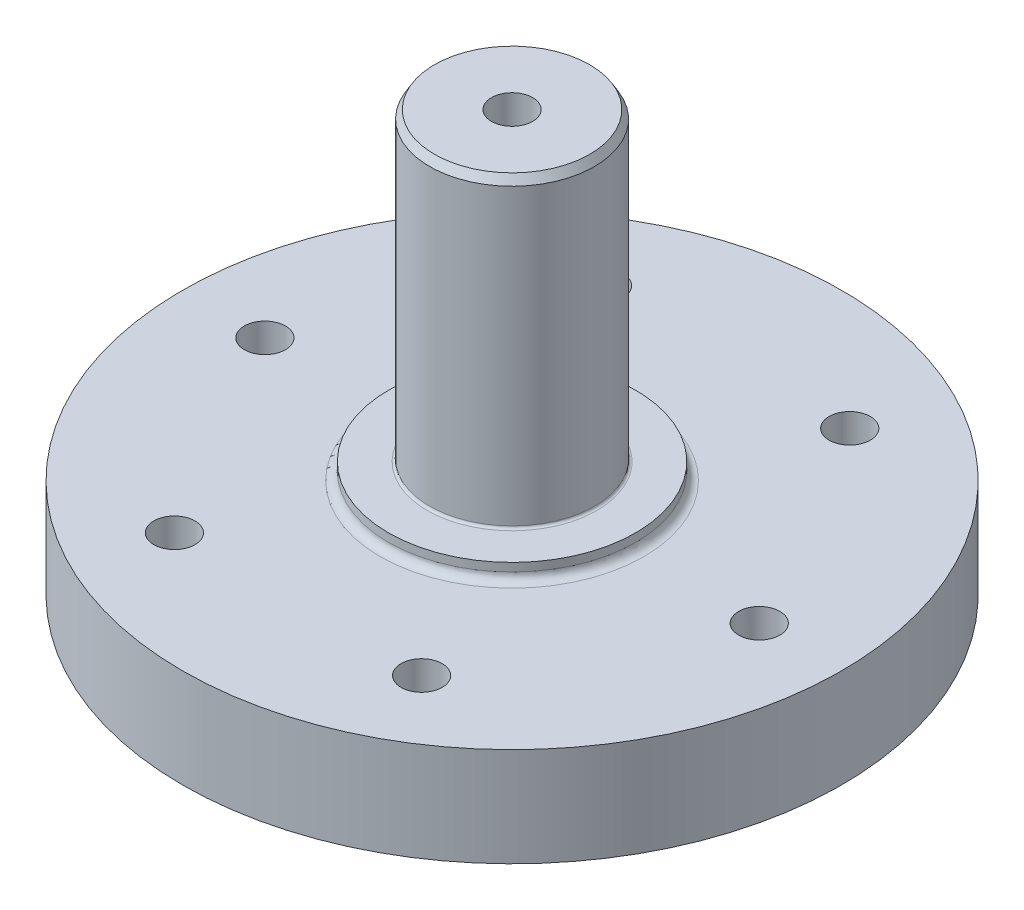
ISO-10303-21;
HEADER;
FILE_DESCRIPTION(('STEP AP214'),'2;1');
FILE_NAME('part.step','',(''),(''),'','','');
FILE_SCHEMA(('AUTOMOTIVE_DESIGN { 1 0 10303 214 1 1 1 1 }'));
ENDSEC;
DATA;
#1=APPLICATION_CONTEXT('core data for automotive mechanical design processes');
#2=APPLICATION_PROTOCOL_DEFINITION('international standard','automotive_design',2000,#1);
#3=PRODUCT_CONTEXT('',#1,'mechanical');
#4=PRODUCT('Part','Part','',(#3));
#5=PRODUCT_RELATED_PRODUCT_CATEGORY('part','',(#4));
#6=PRODUCT_DEFINITION_FORMATION('','',#4);
#7=PRODUCT_DEFINITION_CONTEXT('part definition',#1,'design');
#8=PRODUCT_DEFINITION('design','',#6,#7);
#9=PRODUCT_DEFINITION_SHAPE('','',#8);
#10=(LENGTH_UNIT() NAMED_UNIT(*) SI_UNIT(.MILLI.,.METRE.));
#11=(NAMED_UNIT(*) PLANE_ANGLE_UNIT() SI_UNIT($,.RADIAN.));
#12=(NAMED_UNIT(*) SI_UNIT($,.STERADIAN.) SOLID_ANGLE_UNIT());
#13=UNCERTAINTY_MEASURE_WITH_UNIT(LENGTH_MEASURE(1.E-05),#10,'distance_accuracy_value','');
#14=(GEOMETRIC_REPRESENTATION_CONTEXT(3) GLOBAL_UNCERTAINTY_ASSIGNED_CONTEXT((#13)) GLOBAL_UNIT_ASSIGNED_CONTEXT((#10,
#11,#12)) REPRESENTATION_CONTEXT('',''));
#15=CARTESIAN_POINT('',(0.,0.,0.));
#16=DIRECTION('',(0.,0.,1.));
#17=DIRECTION('',(1.,0.,0.));
#18=AXIS2_PLACEMENT_3D('',#15,#16,#17);
#19=CARTESIAN_POINT('',(10.,51.,0.));
#20=DIRECTION('',(0.,-1.,0.));
#21=DIRECTION('',(0.,0.,-1.));
#22=AXIS2_PLACEMENT_3D('',#19,#20,#21);
#23=PLANE('',#22);
#24=CARTESIAN_POINT('',(0.,51.,0.));
#25=DIRECTION('',(0.,-1.,0.));
#26=DIRECTION('',(0.,0.,-1.));
#27=AXIS2_PLACEMENT_3D('',#24,#25,#26);
#28=CIRCLE('',#27,9.42264973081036);
#29=CARTESIAN_POINT('',(0.,51.,-9.42264973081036));
#30=VERTEX_POINT('',#29);
#31=EDGE_CURVE('E113',#30,#30,#28,.F.);
#32=ORIENTED_EDGE('',*,*,#31,.T.);
#33=EDGE_LOOP('',(#32));
#34=FACE_BOUND('',#33,.T.);
#35=CARTESIAN_POINT('',(0.,51.,0.));
#36=DIRECTION('',(0.,1.,0.));
#37=DIRECTION('',(0.,0.,1.));
#38=AXIS2_PLACEMENT_3D('',#35,#36,#37);
#39=CIRCLE('',#38,2.5);
#40=CARTESIAN_POINT('',(0.,51.,2.5));
#41=VERTEX_POINT('',#40);
#42=EDGE_CURVE('E180',#41,#41,#39,.T.);
#43=ORIENTED_EDGE('',*,*,#42,.F.);
#44=EDGE_LOOP('',(#43));
#45=FACE_BOUND('',#44,.T.);
#46=ADVANCED_FACE('F30',(#34,#45),#23,.F.);
#47=CARTESIAN_POINT('',(0.,-5.,0.));
#48=DIRECTION('',(0.,1.,0.));
#49=DIRECTION('',(0.,0.,1.));
#50=AXIS2_PLACEMENT_3D('',#47,#48,#49);
#51=PLANE('',#50);
#52=CARTESIAN_POINT('',(0.,-5.,0.));
#53=DIRECTION('',(0.,1.,0.));
#54=DIRECTION('',(0.,0.,1.));
#55=AXIS2_PLACEMENT_3D('',#52,#53,#54);
#56=CIRCLE('',#55,9.13397459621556);
#57=CARTESIAN_POINT('',(0.,-5.,9.13397459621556));
#58=VERTEX_POINT('',#57);
#59=EDGE_CURVE('E106',#58,#58,#56,.T.);
#60=ORIENTED_EDGE('',*,*,#59,.F.);
#61=EDGE_LOOP('',(#60));
#62=FACE_BOUND('',#61,.T.);
#63=ADVANCED_FACE('F32',(#62),#51,.F.);
#64=CARTESIAN_POINT('',(0.,-3.5,0.));
#65=DIRECTION('',(0.,1.,0.));
#66=DIRECTION('',(0.,0.,1.));
#67=AXIS2_PLACEMENT_3D('',#64,#65,#66);
#68=CONICAL_SURFACE('',#67,10.,0.523598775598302);
#69=ORIENTED_EDGE('',*,*,#59,.T.);
#70=EDGE_LOOP('',(#69));
#71=FACE_BOUND('',#70,.T.);
#72=CARTESIAN_POINT('',(0.,-3.5,0.));
#73=DIRECTION('',(0.,1.,0.));
#74=DIRECTION('',(0.,0.,1.));
#75=AXIS2_PLACEMENT_3D('',#72,#73,#74);
#76=CIRCLE('',#75,10.);
#77=CARTESIAN_POINT('',(0.,-3.5,10.));
#78=VERTEX_POINT('',#77);
#79=EDGE_CURVE('E109',#78,#78,#76,.T.);
#80=ORIENTED_EDGE('',*,*,#79,.F.);
#81=EDGE_LOOP('',(#80));
#82=FACE_BOUND('',#81,.T.);
#83=ADVANCED_FACE('F64',(#71,#82),#68,.T.);
#84=CARTESIAN_POINT('',(0.,25.7125,0.));
#85=DIRECTION('',(0.,1.,0.));
#86=DIRECTION('',(0.,0.,1.));
#87=AXIS2_PLACEMENT_3D('',#84,#85,#86);
#88=CYLINDRICAL_SURFACE('',#87,10.);
#89=CARTESIAN_POINT('',(0.,0.,0.));
#90=DIRECTION('',(0.,1.,0.));
#91=DIRECTION('',(0.,0.,1.));
#92=AXIS2_PLACEMENT_3D('',#89,#90,#91);
#93=CIRCLE('',#92,10.);
#94=CARTESIAN_POINT('',(0.,0.,10.));
#95=VERTEX_POINT('',#94);
#96=EDGE_CURVE('E111',#95,#95,#93,.T.);
#97=ORIENTED_EDGE('',*,*,#96,.F.);
#98=EDGE_LOOP('',(#97));
#99=FACE_BOUND('',#98,.T.);
#100=ORIENTED_EDGE('',*,*,#79,.T.);
#101=EDGE_LOOP('',(#100));
#102=FACE_BOUND('',#101,.T.);
#103=ADVANCED_FACE('F95',(#99,#102),#88,.T.);
#104=CARTESIAN_POINT('',(10.,0.,0.));
#105=DIRECTION('',(0.,1.,0.));
#106=DIRECTION('',(0.,0.,1.));
#107=AXIS2_PLACEMENT_3D('',#104,#105,#106);
#108=PLANE('',#107);
#109=CARTESIAN_POINT('',(30.,0.,-4.14598910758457E-13));
#110=DIRECTION('',(0.,1.,0.));
#111=DIRECTION('',(0.,0.,1.));
#112=AXIS2_PLACEMENT_3D('',#109,#110,#111);
#113=CIRCLE('',#112,2.5);
#114=CARTESIAN_POINT('',(30.,0.,2.49999999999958));
#115=VERTEX_POINT('',#114);
#116=EDGE_CURVE('E232',#115,#115,#113,.T.);
#117=ORIENTED_EDGE('',*,*,#116,.T.);
#118=EDGE_LOOP('',(#117));
#119=FACE_BOUND('',#118,.T.);
#120=CARTESIAN_POINT('',(15.0000000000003,0.,25.980762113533));
#121=DIRECTION('',(0.,1.,0.));
#122=DIRECTION('',(0.,0.,1.));
#123=AXIS2_PLACEMENT_3D('',#120,#121,#122);
#124=CIRCLE('',#123,2.5);
#125=CARTESIAN_POINT('',(15.0000000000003,0.,28.480762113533));
#126=VERTEX_POINT('',#125);
#127=EDGE_CURVE('E226',#126,#126,#124,.T.);
#128=ORIENTED_EDGE('',*,*,#127,.T.);
#129=EDGE_LOOP('',(#128));
#130=FACE_BOUND('',#129,.T.);
#131=CARTESIAN_POINT('',(-14.9999999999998,0.,25.9807621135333));
#132=DIRECTION('',(0.,1.,0.));
#133=DIRECTION('',(0.,0.,1.));
#134=AXIS2_PLACEMENT_3D('',#131,#132,#133);
#135=CIRCLE('',#134,2.5);
#136=CARTESIAN_POINT('',(-14.9999999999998,0.,28.4807621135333));
#137=VERTEX_POINT('',#136);
#138=EDGE_CURVE('E220',#137,#137,#135,.T.);
#139=ORIENTED_EDGE('',*,*,#138,.T.);
#140=EDGE_LOOP('',(#139));
#141=FACE_BOUND('',#140,.T.);
#142=CARTESIAN_POINT('',(-30.,0.,2.0643209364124E-13));
#143=DIRECTION('',(0.,1.,0.));
#144=DIRECTION('',(0.,0.,1.));
#145=AXIS2_PLACEMENT_3D('',#142,#143,#144);
#146=CIRCLE('',#145,2.5);
#147=CARTESIAN_POINT('',(-30.,0.,2.5000000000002));
#148=VERTEX_POINT('',#147);
#149=EDGE_CURVE('E172',#148,#148,#146,.T.);
#150=ORIENTED_EDGE('',*,*,#149,.T.);
#151=EDGE_LOOP('',(#150));
#152=FACE_BOUND('',#151,.T.);
#153=CARTESIAN_POINT('',(-15.0000000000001,0.,-25.9807621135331));
#154=DIRECTION('',(0.,1.,0.));
#155=DIRECTION('',(0.,0.,1.));
#156=AXIS2_PLACEMENT_3D('',#153,#154,#155);
#157=CIRCLE('',#156,2.5);
#158=CARTESIAN_POINT('',(-15.0000000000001,0.,-23.4807621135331));
#159=VERTEX_POINT('',#158);
#160=EDGE_CURVE('E165',#159,#159,#157,.T.);
#161=ORIENTED_EDGE('',*,*,#160,.T.);
#162=EDGE_LOOP('',(#161));
#163=FACE_BOUND('',#162,.T.);
#164=CARTESIAN_POINT('',(14.9999999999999,0.,-25.9807621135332));
#165=DIRECTION('',(0.,1.,0.));
#166=DIRECTION('',(0.,0.,1.));
#167=AXIS2_PLACEMENT_3D('',#164,#165,#166);
#168=CIRCLE('',#167,2.5);
#169=CARTESIAN_POINT('',(14.9999999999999,0.,-23.4807621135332));
#170=VERTEX_POINT('',#169);
#171=EDGE_CURVE('E170',#170,#170,#168,.T.);
#172=ORIENTED_EDGE('',*,*,#171,.T.);
#173=EDGE_LOOP('',(#172));
#174=FACE_BOUND('',#173,.T.);
#175=CARTESIAN_POINT('',(0.,0.,0.));
#176=DIRECTION('',(0.,1.,0.));
#177=DIRECTION('',(0.,0.,1.));
#178=AXIS2_PLACEMENT_3D('',#175,#176,#177);
#179=CIRCLE('',#178,40.);
#180=CARTESIAN_POINT('',(0.,0.,40.));
#181=VERTEX_POINT('',#180);
#182=EDGE_CURVE('E116',#181,#181,#179,.T.);
#183=ORIENTED_EDGE('',*,*,#182,.F.);
#184=EDGE_LOOP('',(#183));
#185=FACE_BOUND('',#184,.T.);
#186=ORIENTED_EDGE('',*,*,#96,.T.);
#187=EDGE_LOOP('',(#186));
#188=FACE_BOUND('',#187,.T.);
#189=ADVANCED_FACE('F91',(#119,#130,#141,#152,#163,#174,#185,#188),#108,.F.);
#190=CARTESIAN_POINT('',(0.,25.7125,0.));
#191=DIRECTION('',(0.,1.,0.));
#192=DIRECTION('',(0.,0.,1.));
#193=AXIS2_PLACEMENT_3D('',#190,#191,#192);
#194=CYLINDRICAL_SURFACE('',#193,40.);
#195=CARTESIAN_POINT('',(0.,12.,0.));
#196=DIRECTION('',(0.,1.,0.));
#197=DIRECTION('',(0.,0.,1.));
#198=AXIS2_PLACEMENT_3D('',#195,#196,#197);
#199=CIRCLE('',#198,40.);
#200=CARTESIAN_POINT('',(0.,12.,40.));
#201=VERTEX_POINT('',#200);
#202=EDGE_CURVE('E192',#201,#201,#199,.T.);
#203=ORIENTED_EDGE('',*,*,#202,.F.);
#204=EDGE_LOOP('',(#203));
#205=FACE_BOUND('',#204,.T.);
#206=ORIENTED_EDGE('',*,*,#182,.T.);
#207=EDGE_LOOP('',(#206));
#208=FACE_BOUND('',#207,.T.);
#209=ADVANCED_FACE('F87',(#205,#208),#194,.T.);
#210=CARTESIAN_POINT('',(40.,12.,0.));
#211=DIRECTION('',(0.,-1.,0.));
#212=DIRECTION('',(0.,0.,-1.));
#213=AXIS2_PLACEMENT_3D('',#210,#211,#212);
#214=PLANE('',#213);
#215=CARTESIAN_POINT('',(30.,12.,-4.14598910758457E-13));
#216=DIRECTION('',(0.,1.,0.));
#217=DIRECTION('',(-0.866025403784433,0.,0.50000000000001));
#218=AXIS2_PLACEMENT_3D('',#215,#216,#217);
#219=CIRCLE('',#218,2.5);
#220=CARTESIAN_POINT('',(27.8349364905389,12.,1.24999999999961));
#221=VERTEX_POINT('',#220);
#222=EDGE_CURVE('E235',#221,#221,#219,.T.);
#223=ORIENTED_EDGE('',*,*,#222,.F.);
#224=EDGE_LOOP('',(#223));
#225=FACE_BOUND('',#224,.T.);
#226=CARTESIAN_POINT('',(15.0000000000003,12.,25.980762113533));
#227=DIRECTION('',(0.,1.,0.));
#228=DIRECTION('',(-0.866025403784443,0.,-0.499999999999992));
#229=AXIS2_PLACEMENT_3D('',#226,#227,#228);
#230=CIRCLE('',#229,2.5);
#231=CARTESIAN_POINT('',(12.8349364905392,12.,24.730762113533));
#232=VERTEX_POINT('',#231);
#233=EDGE_CURVE('E229',#232,#232,#230,.T.);
#234=ORIENTED_EDGE('',*,*,#233,.F.);
#235=EDGE_LOOP('',(#234));
#236=FACE_BOUND('',#235,.T.);
#237=CARTESIAN_POINT('',(-14.9999999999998,12.,25.9807621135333));
#238=DIRECTION('',(0.,1.,0.));
#239=DIRECTION('',(0.,0.,-1.));
#240=AXIS2_PLACEMENT_3D('',#237,#238,#239);
#241=CIRCLE('',#240,2.5);
#242=CARTESIAN_POINT('',(-14.9999999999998,12.,23.4807621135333));
#243=VERTEX_POINT('',#242);
#244=EDGE_CURVE('E223',#243,#243,#241,.T.);
#245=ORIENTED_EDGE('',*,*,#244,.F.);
#246=EDGE_LOOP('',(#245));
#247=FACE_BOUND('',#246,.T.);
#248=CARTESIAN_POINT('',(-30.,12.,2.0643209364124E-13));
#249=DIRECTION('',(0.,1.,0.));
#250=DIRECTION('',(0.866025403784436,0.,-0.500000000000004));
#251=AXIS2_PLACEMENT_3D('',#248,#249,#250);
#252=CIRCLE('',#251,2.5);
#253=CARTESIAN_POINT('',(-27.8349364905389,12.,-1.2499999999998));
#254=VERTEX_POINT('',#253);
#255=EDGE_CURVE('E217',#254,#254,#252,.T.);
#256=ORIENTED_EDGE('',*,*,#255,.F.);
#257=EDGE_LOOP('',(#256));
#258=FACE_BOUND('',#257,.T.);
#259=CARTESIAN_POINT('',(-15.0000000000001,12.,-25.9807621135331));
#260=DIRECTION('',(0.,1.,0.));
#261=DIRECTION('',(0.86602540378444,0.,0.499999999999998));
#262=AXIS2_PLACEMENT_3D('',#259,#260,#261);
#263=CIRCLE('',#262,2.5);
#264=CARTESIAN_POINT('',(-12.834936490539,12.,-24.7307621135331));
#265=VERTEX_POINT('',#264);
#266=EDGE_CURVE('E162',#265,#265,#263,.T.);
#267=ORIENTED_EDGE('',*,*,#266,.F.);
#268=EDGE_LOOP('',(#267));
#269=FACE_BOUND('',#268,.T.);
#270=CARTESIAN_POINT('',(14.9999999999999,12.,-25.9807621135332));
#271=DIRECTION('',(0.,1.,0.));
#272=DIRECTION('',(0.,0.,1.));
#273=AXIS2_PLACEMENT_3D('',#270,#271,#272);
#274=CIRCLE('',#273,2.5);
#275=CARTESIAN_POINT('',(14.9999999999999,12.,-23.4807621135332));
#276=VERTEX_POINT('',#275);
#277=EDGE_CURVE('E167',#276,#276,#274,.T.);
#278=ORIENTED_EDGE('',*,*,#277,.F.);
#279=EDGE_LOOP('',(#278));
#280=FACE_BOUND('',#279,.T.);
#281=CARTESIAN_POINT('',(0.,12.,0.));
#282=DIRECTION('',(0.,1.,0.));
#283=DIRECTION('',(0.,0.,1.));
#284=AXIS2_PLACEMENT_3D('',#281,#282,#283);
#285=CIRCLE('',#284,16.);
#286=CARTESIAN_POINT('',(0.,12.,16.));
#287=VERTEX_POINT('',#286);
#288=EDGE_CURVE('E189',#287,#287,#285,.T.);
#289=ORIENTED_EDGE('',*,*,#288,.F.);
#290=EDGE_LOOP('',(#289));
#291=FACE_BOUND('',#290,.T.);
#292=ORIENTED_EDGE('',*,*,#202,.T.);
#293=EDGE_LOOP('',(#292));
#294=FACE_BOUND('',#293,.T.);
#295=ADVANCED_FACE('F83',(#225,#236,#247,#258,#269,#280,#291,#294),#214,.F.);
#296=CARTESIAN_POINT('',(0.,13.,0.));
#297=DIRECTION('',(0.,1.,0.));
#298=DIRECTION('',(0.,0.,1.));
#299=AXIS2_PLACEMENT_3D('',#296,#297,#298);
#300=TOROIDAL_SURFACE('',#299,16.,1.);
#301=ORIENTED_EDGE('',*,*,#288,.T.);
#302=EDGE_LOOP('',(#301));
#303=FACE_BOUND('',#302,.T.);
#304=CARTESIAN_POINT('',(0.,13.,0.));
#305=DIRECTION('',(0.,1.,0.));
#306=DIRECTION('',(0.,0.,1.));
#307=AXIS2_PLACEMENT_3D('',#304,#305,#306);
#308=CIRCLE('',#307,15.);
#309=CARTESIAN_POINT('',(0.,13.,15.));
#310=VERTEX_POINT('',#309);
#311=EDGE_CURVE('E186',#310,#310,#308,.T.);
#312=ORIENTED_EDGE('',*,*,#311,.F.);
#313=EDGE_LOOP('',(#312));
#314=FACE_BOUND('',#313,.T.);
#315=ADVANCED_FACE('F79',(#303,#314),#300,.F.);
#316=CARTESIAN_POINT('',(0.,25.7125,0.));
#317=DIRECTION('',(0.,1.,0.));
#318=DIRECTION('',(0.,0.,1.));
#319=AXIS2_PLACEMENT_3D('',#316,#317,#318);
#320=CYLINDRICAL_SURFACE('',#319,15.);
#321=CARTESIAN_POINT('',(0.,14.,0.));
#322=DIRECTION('',(0.,1.,0.));
#323=DIRECTION('',(0.,0.,1.));
#324=AXIS2_PLACEMENT_3D('',#321,#322,#323);
#325=CIRCLE('',#324,15.);
#326=CARTESIAN_POINT('',(0.,14.,15.));
#327=VERTEX_POINT('',#326);
#328=EDGE_CURVE('E183',#327,#327,#325,.T.);
#329=ORIENTED_EDGE('',*,*,#328,.F.);
#330=EDGE_LOOP('',(#329));
#331=FACE_BOUND('',#330,.T.);
#332=ORIENTED_EDGE('',*,*,#311,.T.);
#333=EDGE_LOOP('',(#332));
#334=FACE_BOUND('',#333,.T.);
#335=ADVANCED_FACE('F75',(#331,#334),#320,.T.);
#336=CARTESIAN_POINT('',(15.,14.,0.));
#337=DIRECTION('',(0.,-1.,0.));
#338=DIRECTION('',(0.,0.,-1.));
#339=AXIS2_PLACEMENT_3D('',#336,#337,#338);
#340=PLANE('',#339);
#341=CARTESIAN_POINT('',(0.,14.,0.));
#342=DIRECTION('',(0.,-1.,0.));
#343=DIRECTION('',(0.,0.,-1.));
#344=AXIS2_PLACEMENT_3D('',#341,#342,#343);
#345=CIRCLE('',#344,10.3);
#346=CARTESIAN_POINT('',(0.,14.,-10.3));
#347=VERTEX_POINT('',#346);
#348=EDGE_CURVE('E11',#347,#347,#345,.T.);
#349=ORIENTED_EDGE('',*,*,#348,.T.);
#350=EDGE_LOOP('',(#349));
#351=FACE_BOUND('',#350,.T.);
#352=ORIENTED_EDGE('',*,*,#328,.T.);
#353=EDGE_LOOP('',(#352));
#354=FACE_BOUND('',#353,.T.);
#355=ADVANCED_FACE('F71',(#351,#354),#340,.F.);
#356=CARTESIAN_POINT('',(0.,25.7125,0.));
#357=DIRECTION('',(0.,1.,0.));
#358=DIRECTION('',(0.,0.,1.));
#359=AXIS2_PLACEMENT_3D('',#356,#357,#358);
#360=CYLINDRICAL_SURFACE('',#359,10.);
#361=CARTESIAN_POINT('',(0.,14.3,0.));
#362=DIRECTION('',(0.,-1.,0.));
#363=DIRECTION('',(0.,0.,-1.));
#364=AXIS2_PLACEMENT_3D('',#361,#362,#363);
#365=CIRCLE('',#364,10.);
#366=CARTESIAN_POINT('',(0.,14.3,-10.));
#367=VERTEX_POINT('',#366);
#368=EDGE_CURVE('E37',#367,#367,#365,.F.);
#369=ORIENTED_EDGE('',*,*,#368,.T.);
#370=EDGE_LOOP('',(#369));
#371=FACE_BOUND('',#370,.T.);
#372=CARTESIAN_POINT('',(0.,50.,0.));
#373=DIRECTION('',(0.,-1.,0.));
#374=DIRECTION('',(0.,0.,-1.));
#375=AXIS2_PLACEMENT_3D('',#372,#373,#374);
#376=CIRCLE('',#375,10.);
#377=CARTESIAN_POINT('',(0.,50.,-10.));
#378=VERTEX_POINT('',#377);
#379=EDGE_CURVE('E121',#378,#378,#376,.T.);
#380=ORIENTED_EDGE('',*,*,#379,.T.);
#381=EDGE_LOOP('',(#380));
#382=FACE_BOUND('',#381,.T.);
#383=ADVANCED_FACE('F54',(#371,#382),#360,.T.);
#384=CARTESIAN_POINT('',(0.,51.,0.));
#385=DIRECTION('',(0.,1.,0.));
#386=DIRECTION('',(0.,0.,1.));
#387=AXIS2_PLACEMENT_3D('',#384,#385,#386);
#388=CYLINDRICAL_SURFACE('',#387,2.5);
#389=ORIENTED_EDGE('',*,*,#42,.T.);
#390=EDGE_LOOP('',(#389));
#391=FACE_BOUND('',#390,.T.);
#392=CARTESIAN_POINT('',(0.,34.,0.));
#393=DIRECTION('',(0.,1.,0.));
#394=DIRECTION('',(0.,0.,1.));
#395=AXIS2_PLACEMENT_3D('',#392,#393,#394);
#396=CIRCLE('',#395,2.5);
#397=CARTESIAN_POINT('',(0.,34.,2.5));
#398=VERTEX_POINT('',#397);
#399=EDGE_CURVE('E178',#398,#398,#396,.T.);
#400=ORIENTED_EDGE('',*,*,#399,.F.);
#401=EDGE_LOOP('',(#400));
#402=FACE_BOUND('',#401,.T.);
#403=ADVANCED_FACE('F43',(#391,#402),#388,.F.);
#404=CARTESIAN_POINT('',(0.,32.4978484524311,0.));
#405=DIRECTION('',(0.,1.,0.));
#406=DIRECTION('',(0.,0.,1.));
#407=AXIS2_PLACEMENT_3D('',#404,#405,#406);
#408=CONICAL_SURFACE('',#407,0.,1.02974425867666);
#409=ORIENTED_EDGE('',*,*,#399,.T.);
#410=EDGE_LOOP('',(#409));
#411=FACE_BOUND('',#410,.T.);
#412=CARTESIAN_POINT('',(0.,32.4978484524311,0.));
#413=VERTEX_POINT('',#412);
#414=VERTEX_LOOP('',#413);
#415=FACE_BOUND('',#414,.T.);
#416=ADVANCED_FACE('F40',(#411,#415),#408,.F.);
#417=CARTESIAN_POINT('',(14.9999999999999,-5.,-25.9807621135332));
#418=DIRECTION('',(0.,1.,0.));
#419=DIRECTION('',(0.,0.,1.));
#420=AXIS2_PLACEMENT_3D('',#417,#418,#419);
#421=CYLINDRICAL_SURFACE('',#420,2.5);
#422=ORIENTED_EDGE('',*,*,#277,.T.);
#423=EDGE_LOOP('',(#422));
#424=FACE_BOUND('',#423,.T.);
#425=ORIENTED_EDGE('',*,*,#171,.F.);
#426=EDGE_LOOP('',(#425));
#427=FACE_BOUND('',#426,.T.);
#428=ADVANCED_FACE('F42',(#424,#427),#421,.F.);
#429=CARTESIAN_POINT('',(-15.0000000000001,-5.,-25.9807621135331));
#430=DIRECTION('',(0.,1.,0.));
#431=DIRECTION('',(0.,0.,1.));
#432=AXIS2_PLACEMENT_3D('',#429,#430,#431);
#433=CYLINDRICAL_SURFACE('',#432,2.5);
#434=ORIENTED_EDGE('',*,*,#266,.T.);
#435=EDGE_LOOP('',(#434));
#436=FACE_BOUND('',#435,.T.);
#437=ORIENTED_EDGE('',*,*,#160,.F.);
#438=EDGE_LOOP('',(#437));
#439=FACE_BOUND('',#438,.T.);
#440=ADVANCED_FACE('F50',(#436,#439),#433,.F.);
#441=CARTESIAN_POINT('',(-30.,-5.,2.0643209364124E-13));
#442=DIRECTION('',(0.,1.,0.));
#443=DIRECTION('',(0.,0.,1.));
#444=AXIS2_PLACEMENT_3D('',#441,#442,#443);
#445=CYLINDRICAL_SURFACE('',#444,2.5);
#446=ORIENTED_EDGE('',*,*,#255,.T.);
#447=EDGE_LOOP('',(#446));
#448=FACE_BOUND('',#447,.T.);
#449=ORIENTED_EDGE('',*,*,#149,.F.);
#450=EDGE_LOOP('',(#449));
#451=FACE_BOUND('',#450,.T.);
#452=ADVANCED_FACE('F150',(#448,#451),#445,.F.);
#453=CARTESIAN_POINT('',(-14.9999999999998,-5.,25.9807621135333));
#454=DIRECTION('',(0.,1.,0.));
#455=DIRECTION('',(0.,0.,1.));
#456=AXIS2_PLACEMENT_3D('',#453,#454,#455);
#457=CYLINDRICAL_SURFACE('',#456,2.5);
#458=ORIENTED_EDGE('',*,*,#244,.T.);
#459=EDGE_LOOP('',(#458));
#460=FACE_BOUND('',#459,.T.);
#461=ORIENTED_EDGE('',*,*,#138,.F.);
#462=EDGE_LOOP('',(#461));
#463=FACE_BOUND('',#462,.T.);
#464=ADVANCED_FACE('F146',(#460,#463),#457,.F.);
#465=CARTESIAN_POINT('',(15.0000000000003,-5.,25.980762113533));
#466=DIRECTION('',(0.,1.,0.));
#467=DIRECTION('',(0.,0.,1.));
#468=AXIS2_PLACEMENT_3D('',#465,#466,#467);
#469=CYLINDRICAL_SURFACE('',#468,2.5);
#470=ORIENTED_EDGE('',*,*,#233,.T.);
#471=EDGE_LOOP('',(#470));
#472=FACE_BOUND('',#471,.T.);
#473=ORIENTED_EDGE('',*,*,#127,.F.);
#474=EDGE_LOOP('',(#473));
#475=FACE_BOUND('',#474,.T.);
#476=ADVANCED_FACE('F142',(#472,#475),#469,.F.);
#477=CARTESIAN_POINT('',(30.,-5.,-4.14598910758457E-13));
#478=DIRECTION('',(0.,1.,0.));
#479=DIRECTION('',(0.,0.,1.));
#480=AXIS2_PLACEMENT_3D('',#477,#478,#479);
#481=CYLINDRICAL_SURFACE('',#480,2.5);
#482=ORIENTED_EDGE('',*,*,#222,.T.);
#483=EDGE_LOOP('',(#482));
#484=FACE_BOUND('',#483,.T.);
#485=ORIENTED_EDGE('',*,*,#116,.F.);
#486=EDGE_LOOP('',(#485));
#487=FACE_BOUND('',#486,.T.);
#488=ADVANCED_FACE('F135',(#484,#487),#481,.F.);
#489=CARTESIAN_POINT('',(0.,51.,0.));
#490=DIRECTION('',(0.,-1.,0.));
#491=DIRECTION('',(0.,0.,-1.));
#492=AXIS2_PLACEMENT_3D('',#489,#490,#491);
#493=CONICAL_SURFACE('',#492,9.42264973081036,0.523598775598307);
#494=ORIENTED_EDGE('',*,*,#379,.F.);
#495=EDGE_LOOP('',(#494));
#496=FACE_BOUND('',#495,.T.);
#497=ORIENTED_EDGE('',*,*,#31,.F.);
#498=EDGE_LOOP('',(#497));
#499=FACE_BOUND('',#498,.T.);
#500=ADVANCED_FACE('F129',(#496,#499),#493,.T.);
#501=CARTESIAN_POINT('',(0.,14.3,0.));
#502=DIRECTION('',(0.,-1.,0.));
#503=DIRECTION('',(0.,0.,-1.));
#504=AXIS2_PLACEMENT_3D('',#501,#502,#503);
#505=TOROIDAL_SURFACE('',#504,10.3,0.3);
#506=ORIENTED_EDGE('',*,*,#348,.F.);
#507=EDGE_LOOP('',(#506));
#508=FACE_BOUND('',#507,.T.);
#509=ORIENTED_EDGE('',*,*,#368,.F.);
#510=EDGE_LOOP('',(#509));
#511=FACE_BOUND('',#510,.T.);
#512=ADVANCED_FACE('F127',(#508,#511),#505,.F.);
#513=CLOSED_SHELL('',(#46,#63,#83,#103,#189,#209,#295,#315,#335,#355,#383,#403,#416,#428,#440,
#452,#464,#476,#488,#500,#512));
#514=MANIFOLD_SOLID_BREP('B2',#513);
#515=ADVANCED_BREP_SHAPE_REPRESENTATION('',(#18,#514),#14);
#516=SHAPE_DEFINITION_REPRESENTATION(#9,#515);
ENDSEC;
END-ISO-10303-21;
